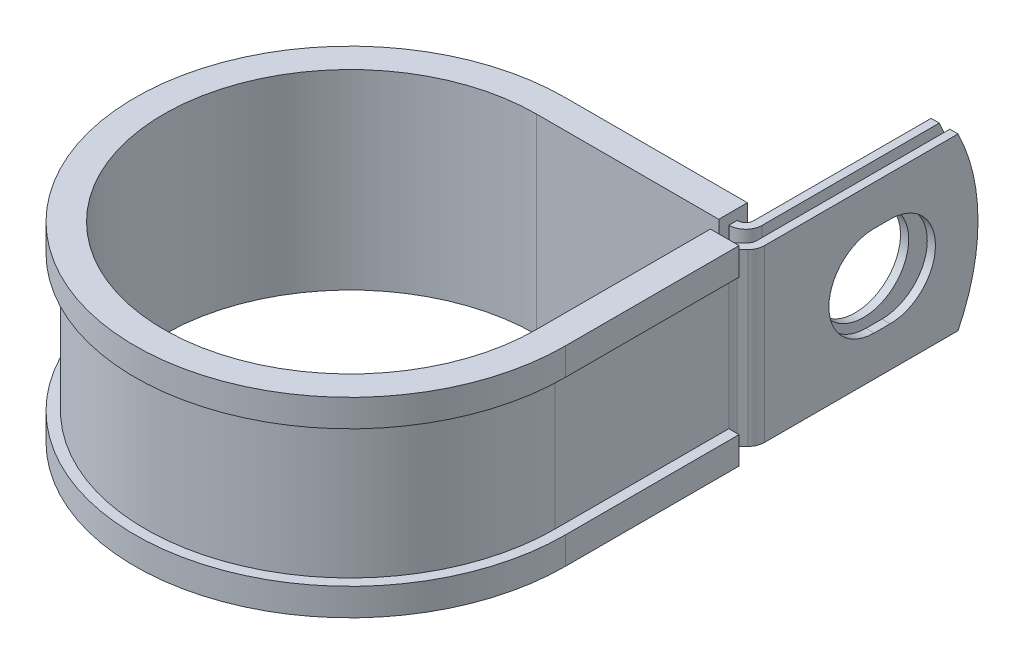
from build123d import *

# Parameters (mm, degrees)
EXTRUDE_THIN1_DEPTH = 12.7
SKETCH2_R           = 6.7437
CUT_EXTRUDE1_DEPTH  = 1.2192
CUT_EXTRUDE2_DEPTH  = 1.2192
CUT_EXTRUDE3_DEPTH  = 86.834941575


with BuildPart() as part:
    # Sketch1 → Extrude-Thin1 (new, symmetric)
    with BuildSketch(Plane(origin=(0, 0, 0), x_dir=(1, 0, 0), z_dir=(0, 1, 0))):
        with BuildLine():
            Line((31.1963698, 61.1124), (31.1963698, 29.2989))
            ThreePointArc((31.1963698, 29.2989), (31.103563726, 28.832332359), (30.839274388, 28.436795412))
            Line((30.839274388, 28.436795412), (30.013090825, 27.610611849))
            ThreePointArc((30.013090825, 27.610611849), (29.484512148, 26.819537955), (29.2989, 25.886402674))
            Line((29.2989, 25.886402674), (29.2989, 0))
            ThreePointArc((29.2989, 0), (-20.717450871, -20.717450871), (0, 29.2989))
            Line((0, 29.2989), (27.1831698, 29.2989))
            ThreePointArc((27.1831698, 29.2989), (28.907378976, 30.013090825), (29.6215698, 31.7373))
            Line((29.6215698, 31.7373), (29.6215698, 61.1124))
            Line((29.6215698, 61.1124), (28.4023698, 61.1124))
            Line((28.4023698, 61.1124), (28.4023698, 31.7373))
            ThreePointArc((28.4023698, 31.7373), (28.045274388, 30.875195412), (27.1831698, 30.5181))
            Line((27.1831698, 30.5181), (0, 30.5181))
            ThreePointArc((0, 30.5181), (-21.579555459, -21.579555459), (30.5181, 0))
            Line((30.5181, 0), (30.5181, 25.886402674))
            ThreePointArc((30.5181, 25.886402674), (30.610906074, 26.352970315), (30.875195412, 26.748507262))
            Line((30.875195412, 26.748507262), (31.701378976, 27.574690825))
            ThreePointArc((31.701378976, 27.574690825), (32.229957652, 28.365764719), (32.4155698, 29.2989))
            Line((32.4155698, 29.2989), (32.4155698, 61.1124))
            Line((32.4155698, 61.1124), (31.1963698, 61.1124))
        make_face()
    extrude(amount=EXTRUDE_THIN1_DEPTH, both=True)

    # Sketch2 → Cut-Extrude1 (cut)
    with BuildSketch(Plane.ZY.offset(-28.4023698)):
        with Locations((-46.8376, 0)):
            Circle(SKETCH2_R)
    extrude(amount=-CUT_EXTRUDE1_DEPTH, mode=Mode.SUBTRACT)

    # Sketch3 → Cut-Extrude2 (cut)
    with BuildSketch(Plane(origin=(32.4155698, 0, 0), x_dir=(0, 0, -1), z_dir=(1, 0, 0))):
        with BuildLine():
            Line((45.6438, 6.7437), (48.0314, 6.7437))
            ThreePointArc((48.0314, 6.7437), (54.7751, 0), (48.0314, -6.7437))
            Line((48.0314, -6.7437), (45.6438, -6.7437))
            ThreePointArc((45.6438, -6.7437), (38.9001, 0), (45.6438, 6.7437))
        make_face()
    extrude(amount=-CUT_EXTRUDE2_DEPTH, mode=Mode.SUBTRACT)

    # Sketch4 → Cut-Extrude3 (cut, through all)
    with BuildSketch(Plane.ZY.offset(-28.4023698)):
        with BuildLine():
            Line((-58.135068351, 12.7), (-61.1124, 12.7))
            Line((-61.1124, 12.7), (-61.1124, 0))
            ThreePointArc((-61.1124, 0), (-60.358111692, 6.522164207), (-58.135068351, 12.7))
        make_face()
        with BuildLine():
            ThreePointArc((-58.135068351, -12.7), (-60.358111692, -6.522164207), (-61.1124, 0))
            Line((-61.1124, 0), (-61.1124, -12.7))
            Line((-61.1124, -12.7), (-58.135068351, -12.7))
        make_face()
    extrude(amount=-CUT_EXTRUDE3_DEPTH, mode=Mode.SUBTRACT)

    # Sweep1: sweep along a path in Sketch6
    with BuildLine(Plane(origin=(0, 12.7, 0), x_dir=(1, 0, 0), z_dir=(0, 1, 0))) as sweep1_path:
        Line((27.7749, 25.886402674), (27.7749, 0))
        ThreePointArc((27.7749, 0), (-19.639820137, -19.639820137), (0, 27.7749))
        Line((0, 27.7749), (27.1323698, 27.7749))
    # Sketch5 → Sweep1 (sweep)
    with BuildSketch(Plane(origin=(0, 0, -25.886402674), x_dir=(-1, 0, 0), z_dir=(0, 0, -1))):
        Polygon((-30.5181, 12.7), (-29.2989, 12.7), (-29.2989, -12.7), (-30.5181, -12.7), (-30.5181, -10.16), (-32.0421, -10.16), (-32.0421, -14.224), (-27.7749, -14.224), (-27.7749, 14.224), (-32.0421, 14.224), (-32.0421, 10.16), (-30.5181, 10.16), align=None)
    sweep(path=sweep1_path.line)


solid = part.part
